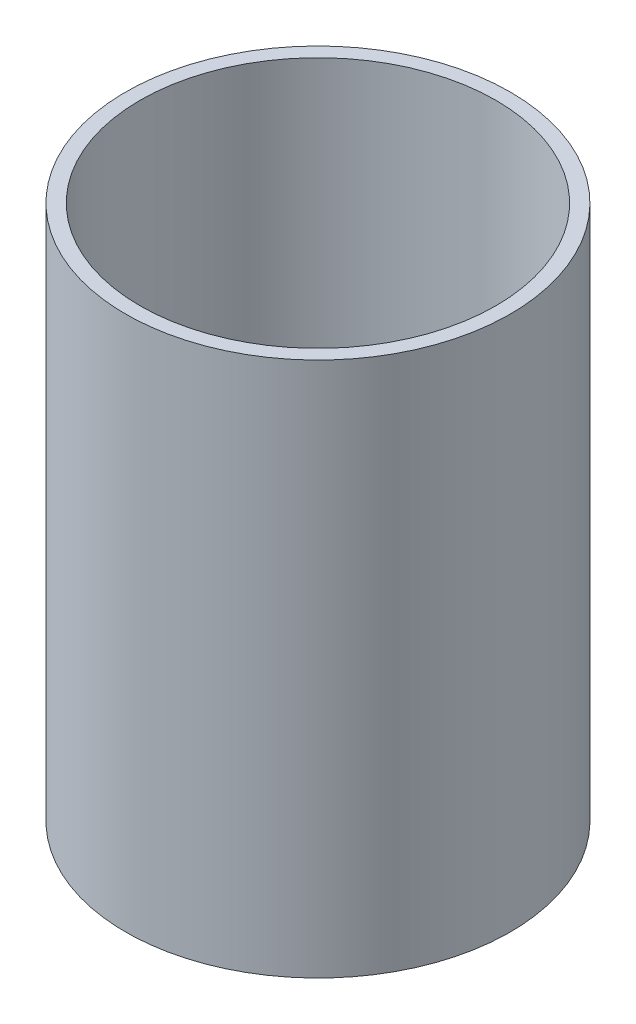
ISO-10303-21;
HEADER;
FILE_DESCRIPTION(('STEP AP214'),'2;1');
FILE_NAME('part.step','',(''),(''),'','','');
FILE_SCHEMA(('AUTOMOTIVE_DESIGN { 1 0 10303 214 1 1 1 1 }'));
ENDSEC;
DATA;
#1=APPLICATION_CONTEXT('core data for automotive mechanical design processes');
#2=APPLICATION_PROTOCOL_DEFINITION('international standard','automotive_design',2000,#1);
#3=PRODUCT_CONTEXT('',#1,'mechanical');
#4=PRODUCT('Part','Part','',(#3));
#5=PRODUCT_RELATED_PRODUCT_CATEGORY('part','',(#4));
#6=PRODUCT_DEFINITION_FORMATION('','',#4);
#7=PRODUCT_DEFINITION_CONTEXT('part definition',#1,'design');
#8=PRODUCT_DEFINITION('design','',#6,#7);
#9=PRODUCT_DEFINITION_SHAPE('','',#8);
#10=(LENGTH_UNIT() NAMED_UNIT(*) SI_UNIT(.MILLI.,.METRE.));
#11=(NAMED_UNIT(*) PLANE_ANGLE_UNIT() SI_UNIT($,.RADIAN.));
#12=(NAMED_UNIT(*) SI_UNIT($,.STERADIAN.) SOLID_ANGLE_UNIT());
#13=UNCERTAINTY_MEASURE_WITH_UNIT(LENGTH_MEASURE(1.E-05),#10,'distance_accuracy_value','');
#14=(GEOMETRIC_REPRESENTATION_CONTEXT(3) GLOBAL_UNCERTAINTY_ASSIGNED_CONTEXT((#13)) GLOBAL_UNIT_ASSIGNED_CONTEXT((#10,
#11,#12)) REPRESENTATION_CONTEXT('',''));
#15=CARTESIAN_POINT('',(0.,0.,0.));
#16=DIRECTION('',(0.,0.,1.));
#17=DIRECTION('',(1.,0.,0.));
#18=AXIS2_PLACEMENT_3D('',#15,#16,#17);
#19=CARTESIAN_POINT('',(0.,304.8,0.));
#20=DIRECTION('',(0.,1.,0.));
#21=DIRECTION('',(0.,0.,1.));
#22=AXIS2_PLACEMENT_3D('',#19,#20,#21);
#23=PLANE('',#22);
#24=CARTESIAN_POINT('',(0.,304.8,0.));
#25=DIRECTION('',(0.,1.,0.));
#26=DIRECTION('',(0.,0.,1.));
#27=AXIS2_PLACEMENT_3D('',#24,#25,#26);
#28=CIRCLE('',#27,109.5375);
#29=CARTESIAN_POINT('',(0.,304.8,-109.5375));
#30=VERTEX_POINT('',#29);
#31=EDGE_CURVE('E10',#30,#30,#28,.T.);
#32=ORIENTED_EDGE('',*,*,#31,.T.);
#33=EDGE_LOOP('',(#32));
#34=FACE_BOUND('',#33,.T.);
#35=CARTESIAN_POINT('',(0.,304.8,0.));
#36=DIRECTION('',(0.,1.,0.));
#37=DIRECTION('',(0.,0.,1.));
#38=AXIS2_PLACEMENT_3D('',#35,#36,#37);
#39=CIRCLE('',#38,101.3587);
#40=CARTESIAN_POINT('',(0.,304.8,-101.3587));
#41=VERTEX_POINT('',#40);
#42=EDGE_CURVE('E43',#41,#41,#39,.T.);
#43=ORIENTED_EDGE('',*,*,#42,.F.);
#44=EDGE_LOOP('',(#43));
#45=FACE_BOUND('',#44,.T.);
#46=ADVANCED_FACE('F32',(#34,#45),#23,.T.);
#47=CARTESIAN_POINT('',(0.,0.,0.));
#48=DIRECTION('',(0.,1.,0.));
#49=DIRECTION('',(0.,0.,1.));
#50=AXIS2_PLACEMENT_3D('',#47,#48,#49);
#51=PLANE('',#50);
#52=CARTESIAN_POINT('',(0.,0.,0.));
#53=DIRECTION('',(0.,1.,0.));
#54=DIRECTION('',(0.,0.,1.));
#55=AXIS2_PLACEMENT_3D('',#52,#53,#54);
#56=CIRCLE('',#55,109.5375);
#57=CARTESIAN_POINT('',(0.,0.,-109.5375));
#58=VERTEX_POINT('',#57);
#59=EDGE_CURVE('E36',#58,#58,#56,.T.);
#60=ORIENTED_EDGE('',*,*,#59,.F.);
#61=EDGE_LOOP('',(#60));
#62=FACE_BOUND('',#61,.T.);
#63=CARTESIAN_POINT('',(0.,0.,0.));
#64=DIRECTION('',(0.,1.,0.));
#65=DIRECTION('',(0.,0.,1.));
#66=AXIS2_PLACEMENT_3D('',#63,#64,#65);
#67=CIRCLE('',#66,101.3587);
#68=CARTESIAN_POINT('',(0.,0.,-101.3587));
#69=VERTEX_POINT('',#68);
#70=EDGE_CURVE('E45',#69,#69,#67,.T.);
#71=ORIENTED_EDGE('',*,*,#70,.T.);
#72=EDGE_LOOP('',(#71));
#73=FACE_BOUND('',#72,.T.);
#74=ADVANCED_FACE('F55',(#62,#73),#51,.F.);
#75=CARTESIAN_POINT('',(0.,304.8,0.));
#76=DIRECTION('',(0.,-1.,0.));
#77=DIRECTION('',(0.,0.,-1.));
#78=AXIS2_PLACEMENT_3D('',#75,#76,#77);
#79=CYLINDRICAL_SURFACE('',#78,109.5375);
#80=CARTESIAN_POINT('',(0.,304.8,-109.5375));
#81=CARTESIAN_POINT('',(0.,301.625,-109.5375));
#82=CARTESIAN_POINT('',(0.,298.45,-109.5375));
#83=CARTESIAN_POINT('',(0.,292.1,-109.5375));
#84=CARTESIAN_POINT('',(0.,288.925,-109.5375));
#85=CARTESIAN_POINT('',(0.,282.575,-109.5375));
#86=CARTESIAN_POINT('',(0.,279.4,-109.5375));
#87=CARTESIAN_POINT('',(0.,273.05,-109.5375));
#88=CARTESIAN_POINT('',(0.,269.875,-109.5375));
#89=CARTESIAN_POINT('',(0.,263.525,-109.5375));
#90=CARTESIAN_POINT('',(0.,260.35,-109.5375));
#91=CARTESIAN_POINT('',(0.,254.,-109.5375));
#92=CARTESIAN_POINT('',(0.,250.825,-109.5375));
#93=CARTESIAN_POINT('',(0.,244.475,-109.5375));
#94=CARTESIAN_POINT('',(0.,241.3,-109.5375));
#95=CARTESIAN_POINT('',(0.,234.95,-109.5375));
#96=CARTESIAN_POINT('',(0.,231.775,-109.5375));
#97=CARTESIAN_POINT('',(0.,225.425,-109.5375));
#98=CARTESIAN_POINT('',(0.,222.25,-109.5375));
#99=CARTESIAN_POINT('',(0.,215.9,-109.5375));
#100=CARTESIAN_POINT('',(0.,212.725,-109.5375));
#101=CARTESIAN_POINT('',(0.,206.375,-109.5375));
#102=CARTESIAN_POINT('',(0.,203.2,-109.5375));
#103=CARTESIAN_POINT('',(0.,196.85,-109.5375));
#104=CARTESIAN_POINT('',(0.,193.675,-109.5375));
#105=CARTESIAN_POINT('',(0.,187.325,-109.5375));
#106=CARTESIAN_POINT('',(0.,184.15,-109.5375));
#107=CARTESIAN_POINT('',(0.,177.8,-109.5375));
#108=CARTESIAN_POINT('',(0.,174.625,-109.5375));
#109=CARTESIAN_POINT('',(0.,168.275,-109.5375));
#110=CARTESIAN_POINT('',(0.,165.1,-109.5375));
#111=CARTESIAN_POINT('',(0.,158.75,-109.5375));
#112=CARTESIAN_POINT('',(0.,155.575,-109.5375));
#113=CARTESIAN_POINT('',(0.,149.225,-109.5375));
#114=CARTESIAN_POINT('',(0.,146.05,-109.5375));
#115=CARTESIAN_POINT('',(0.,139.7,-109.5375));
#116=CARTESIAN_POINT('',(0.,136.525,-109.5375));
#117=CARTESIAN_POINT('',(0.,130.175,-109.5375));
#118=CARTESIAN_POINT('',(0.,127.,-109.5375));
#119=CARTESIAN_POINT('',(0.,120.65,-109.5375));
#120=CARTESIAN_POINT('',(0.,117.475,-109.5375));
#121=CARTESIAN_POINT('',(0.,111.125,-109.5375));
#122=CARTESIAN_POINT('',(0.,107.95,-109.5375));
#123=CARTESIAN_POINT('',(0.,101.6,-109.5375));
#124=CARTESIAN_POINT('',(0.,98.425,-109.5375));
#125=CARTESIAN_POINT('',(0.,92.075,-109.5375));
#126=CARTESIAN_POINT('',(0.,88.9,-109.5375));
#127=CARTESIAN_POINT('',(0.,82.55,-109.5375));
#128=CARTESIAN_POINT('',(0.,79.375,-109.5375));
#129=CARTESIAN_POINT('',(0.,73.025,-109.5375));
#130=CARTESIAN_POINT('',(0.,69.85,-109.5375));
#131=CARTESIAN_POINT('',(0.,63.5,-109.5375));
#132=CARTESIAN_POINT('',(0.,60.325,-109.5375));
#133=CARTESIAN_POINT('',(0.,53.975,-109.5375));
#134=CARTESIAN_POINT('',(0.,50.8,-109.5375));
#135=CARTESIAN_POINT('',(0.,44.45,-109.5375));
#136=CARTESIAN_POINT('',(0.,41.275,-109.5375));
#137=CARTESIAN_POINT('',(0.,34.925,-109.5375));
#138=CARTESIAN_POINT('',(0.,31.75,-109.5375));
#139=CARTESIAN_POINT('',(0.,25.4,-109.5375));
#140=CARTESIAN_POINT('',(0.,22.225,-109.5375));
#141=CARTESIAN_POINT('',(0.,15.875,-109.5375));
#142=CARTESIAN_POINT('',(0.,12.7,-109.5375));
#143=CARTESIAN_POINT('',(0.,6.35,-109.5375));
#144=CARTESIAN_POINT('',(0.,3.175,-109.5375));
#145=CARTESIAN_POINT('',(0.,0.,-109.5375));
#146=B_SPLINE_CURVE_WITH_KNOTS('',3,(#80,#81,#82,#83,#84,#85,#86,#87,#88,#89,#90,#91,#92,#93,
#94,#95,#96,#97,#98,#99,#100,#101,#102,#103,#104,#105,#106,#107,#108,#109,#110,#111,#112,#113,
#114,#115,#116,#117,#118,#119,#120,#121,#122,#123,#124,#125,#126,#127,#128,#129,#130,#131,#132,
#133,#134,#135,#136,#137,#138,#139,#140,#141,#142,#143,#144,#145),.UNSPECIFIED.,.F.,.F.,(4,2,2,
2,2,2,2,2,2,2,2,2,2,2,2,2,2,2,2,2,2,2,2,2,2,2,2,2,2,2,2,2,4),(0.,9.52499999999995,19.05,28.575,
38.1,47.625,57.15,66.675,76.2,85.725,95.2499999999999,104.775,114.3,123.825,133.35,142.875,
152.4,161.925,171.45,180.975,190.5,200.025,209.55,219.075,228.6,238.125,247.65,257.175,266.7,
276.225,285.75,295.275,304.8),.UNSPECIFIED.);
#147=EDGE_CURVE('BSEAM34',#30,#58,#146,.T.);
#148=ORIENTED_EDGE('',*,*,#31,.F.);
#149=ORIENTED_EDGE('',*,*,#59,.T.);
#150=ORIENTED_EDGE('',*,*,#147,.T.);
#151=ORIENTED_EDGE('',*,*,#147,.F.);
#152=EDGE_LOOP('',(#148,#150,#149,#151));
#153=FACE_BOUND('',#152,.T.);
#154=ADVANCED_FACE('F34',(#153),#79,.T.);
#155=CARTESIAN_POINT('',(0.,304.8,0.));
#156=DIRECTION('',(0.,-1.,0.));
#157=DIRECTION('',(0.,0.,-1.));
#158=AXIS2_PLACEMENT_3D('',#155,#156,#157);
#159=CYLINDRICAL_SURFACE('',#158,101.3587);
#160=CARTESIAN_POINT('',(0.,304.8,-101.3587));
#161=CARTESIAN_POINT('',(0.,301.625,-101.3587));
#162=CARTESIAN_POINT('',(0.,298.45,-101.3587));
#163=CARTESIAN_POINT('',(0.,292.1,-101.3587));
#164=CARTESIAN_POINT('',(0.,288.925,-101.3587));
#165=CARTESIAN_POINT('',(0.,282.575,-101.3587));
#166=CARTESIAN_POINT('',(0.,279.4,-101.3587));
#167=CARTESIAN_POINT('',(0.,273.05,-101.3587));
#168=CARTESIAN_POINT('',(0.,269.875,-101.3587));
#169=CARTESIAN_POINT('',(0.,263.525,-101.3587));
#170=CARTESIAN_POINT('',(0.,260.35,-101.3587));
#171=CARTESIAN_POINT('',(0.,254.,-101.3587));
#172=CARTESIAN_POINT('',(0.,250.825,-101.3587));
#173=CARTESIAN_POINT('',(0.,244.475,-101.3587));
#174=CARTESIAN_POINT('',(0.,241.3,-101.3587));
#175=CARTESIAN_POINT('',(0.,234.95,-101.3587));
#176=CARTESIAN_POINT('',(0.,231.775,-101.3587));
#177=CARTESIAN_POINT('',(0.,225.425,-101.3587));
#178=CARTESIAN_POINT('',(0.,222.25,-101.3587));
#179=CARTESIAN_POINT('',(0.,215.9,-101.3587));
#180=CARTESIAN_POINT('',(0.,212.725,-101.3587));
#181=CARTESIAN_POINT('',(0.,206.375,-101.3587));
#182=CARTESIAN_POINT('',(0.,203.2,-101.3587));
#183=CARTESIAN_POINT('',(0.,196.85,-101.3587));
#184=CARTESIAN_POINT('',(0.,193.675,-101.3587));
#185=CARTESIAN_POINT('',(0.,187.325,-101.3587));
#186=CARTESIAN_POINT('',(0.,184.15,-101.3587));
#187=CARTESIAN_POINT('',(0.,177.8,-101.3587));
#188=CARTESIAN_POINT('',(0.,174.625,-101.3587));
#189=CARTESIAN_POINT('',(0.,168.275,-101.3587));
#190=CARTESIAN_POINT('',(0.,165.1,-101.3587));
#191=CARTESIAN_POINT('',(0.,158.75,-101.3587));
#192=CARTESIAN_POINT('',(0.,155.575,-101.3587));
#193=CARTESIAN_POINT('',(0.,149.225,-101.3587));
#194=CARTESIAN_POINT('',(0.,146.05,-101.3587));
#195=CARTESIAN_POINT('',(0.,139.7,-101.3587));
#196=CARTESIAN_POINT('',(0.,136.525,-101.3587));
#197=CARTESIAN_POINT('',(0.,130.175,-101.3587));
#198=CARTESIAN_POINT('',(0.,127.,-101.3587));
#199=CARTESIAN_POINT('',(0.,120.65,-101.3587));
#200=CARTESIAN_POINT('',(0.,117.475,-101.3587));
#201=CARTESIAN_POINT('',(0.,111.125,-101.3587));
#202=CARTESIAN_POINT('',(0.,107.95,-101.3587));
#203=CARTESIAN_POINT('',(0.,101.6,-101.3587));
#204=CARTESIAN_POINT('',(0.,98.425,-101.3587));
#205=CARTESIAN_POINT('',(0.,92.075,-101.3587));
#206=CARTESIAN_POINT('',(0.,88.9,-101.3587));
#207=CARTESIAN_POINT('',(0.,82.55,-101.3587));
#208=CARTESIAN_POINT('',(0.,79.375,-101.3587));
#209=CARTESIAN_POINT('',(0.,73.025,-101.3587));
#210=CARTESIAN_POINT('',(0.,69.85,-101.3587));
#211=CARTESIAN_POINT('',(0.,63.5,-101.3587));
#212=CARTESIAN_POINT('',(0.,60.325,-101.3587));
#213=CARTESIAN_POINT('',(0.,53.975,-101.3587));
#214=CARTESIAN_POINT('',(0.,50.8,-101.3587));
#215=CARTESIAN_POINT('',(0.,44.45,-101.3587));
#216=CARTESIAN_POINT('',(0.,41.275,-101.3587));
#217=CARTESIAN_POINT('',(0.,34.925,-101.3587));
#218=CARTESIAN_POINT('',(0.,31.75,-101.3587));
#219=CARTESIAN_POINT('',(0.,25.4,-101.3587));
#220=CARTESIAN_POINT('',(0.,22.225,-101.3587));
#221=CARTESIAN_POINT('',(0.,15.875,-101.3587));
#222=CARTESIAN_POINT('',(0.,12.7,-101.3587));
#223=CARTESIAN_POINT('',(0.,6.35,-101.3587));
#224=CARTESIAN_POINT('',(0.,3.175,-101.3587));
#225=CARTESIAN_POINT('',(0.,0.,-101.3587));
#226=B_SPLINE_CURVE_WITH_KNOTS('',3,(#160,#161,#162,#163,#164,#165,#166,#167,#168,#169,#170,
#171,#172,#173,#174,#175,#176,#177,#178,#179,#180,#181,#182,#183,#184,#185,#186,#187,#188,#189,
#190,#191,#192,#193,#194,#195,#196,#197,#198,#199,#200,#201,#202,#203,#204,#205,#206,#207,#208,
#209,#210,#211,#212,#213,#214,#215,#216,#217,#218,#219,#220,#221,#222,#223,#224,#225),
.UNSPECIFIED.,.F.,.F.,(4,2,2,2,2,2,2,2,2,2,2,2,2,2,2,2,2,2,2,2,2,2,2,2,2,2,2,2,2,2,2,2,4),(0.,
9.52500000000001,19.05,28.575,38.1,47.625,57.15,66.675,76.2,85.7250000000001,95.2500000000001,
104.775,114.3,123.825,133.35,142.875,152.4,161.925,171.45,180.975,190.5,200.025,209.55,219.075,
228.6,238.125,247.65,257.175,266.7,276.225,285.75,295.275,304.8),.UNSPECIFIED.);
#227=EDGE_CURVE('BSEAM51',#41,#69,#226,.T.);
#228=ORIENTED_EDGE('',*,*,#42,.T.);
#229=ORIENTED_EDGE('',*,*,#70,.F.);
#230=ORIENTED_EDGE('',*,*,#227,.T.);
#231=ORIENTED_EDGE('',*,*,#227,.F.);
#232=EDGE_LOOP('',(#228,#230,#229,#231));
#233=FACE_BOUND('',#232,.T.);
#234=ADVANCED_FACE('F51',(#233),#159,.F.);
#235=CLOSED_SHELL('',(#46,#74,#154,#234));
#236=MANIFOLD_SOLID_BREP('B2',#235);
#237=ADVANCED_BREP_SHAPE_REPRESENTATION('',(#18,#236),#14);
#238=SHAPE_DEFINITION_REPRESENTATION(#9,#237);
ENDSEC;
END-ISO-10303-21;
